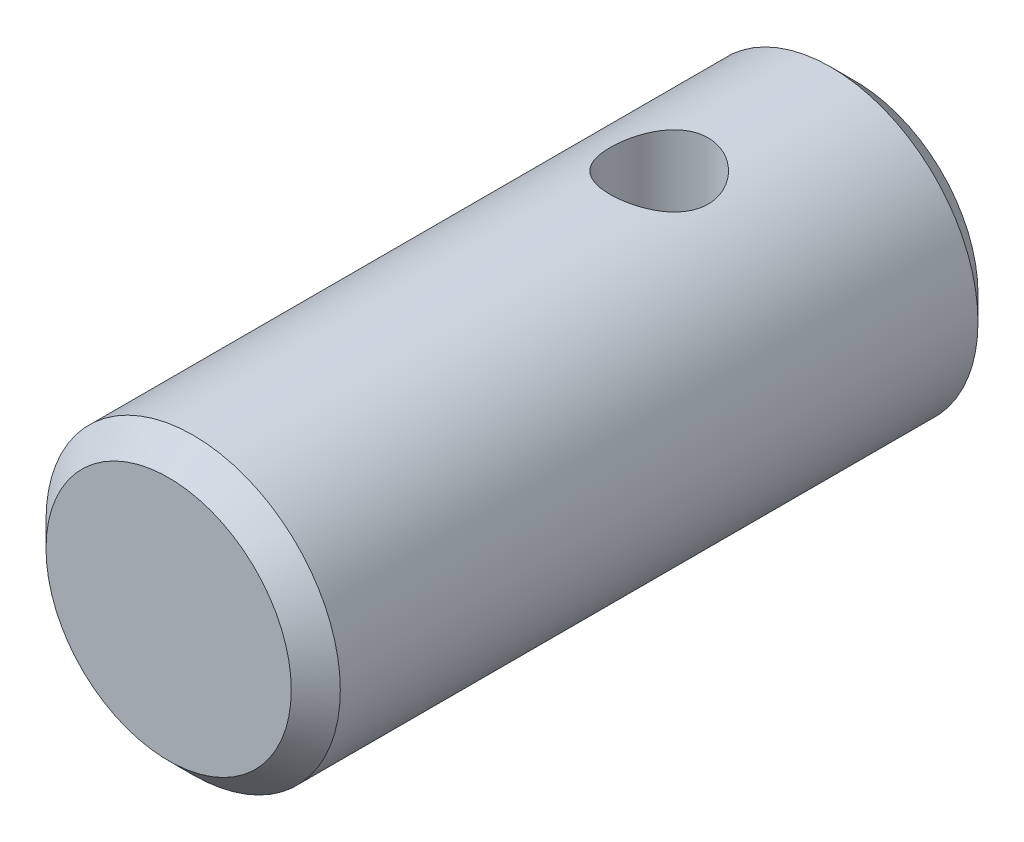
from build123d import *

# Parameters (mm, degrees)
ESQUISSE1_R           = 3
EXTRUSION1_DEPTH      = 7
CHANFREIN1_SIZE       = 0.5
EXTRUSION2_DEPTH      = 9.185352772
EXTRUSION2_DEPTH_BACK = 9.185352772
ESQUISSE2_R           = 1
ESQUISSE2_R_2         = 0.8


with BuildPart() as part:
    # Esquisse1 → Extrusion1 (new, symmetric)
    with BuildSketch(Plane.XY):
        Circle(ESQUISSE1_R)
    extrude(amount=EXTRUSION1_DEPTH, both=True)

    # Chanfrein1
    chanfrein1_edges = [part.edges().sort_by_distance(p)[0] for p in [
        (-3, 0, -7),
        (-3, 0, 7),
    ]]
    chamfer(chanfrein1_edges, length=CHANFREIN1_SIZE)

    # Esquisse2 → Extrusion2 (cut, two sides: drawn at the far end of the back side and taken through both)
    with BuildSketch(Plane(origin=(0, 0, 0), x_dir=(1, 0, 0), z_dir=(0, 1, 0)).offset(-EXTRUSION2_DEPTH_BACK)):
        with Locations(Location((0, 3, 0), (0, 0, 270))):
            Circle(ESQUISSE2_R)
        with Locations((0, -24)):
            Circle(ESQUISSE2_R_2)
    extrude(amount=EXTRUSION2_DEPTH + EXTRUSION2_DEPTH_BACK, mode=Mode.SUBTRACT)


solid = part.part
